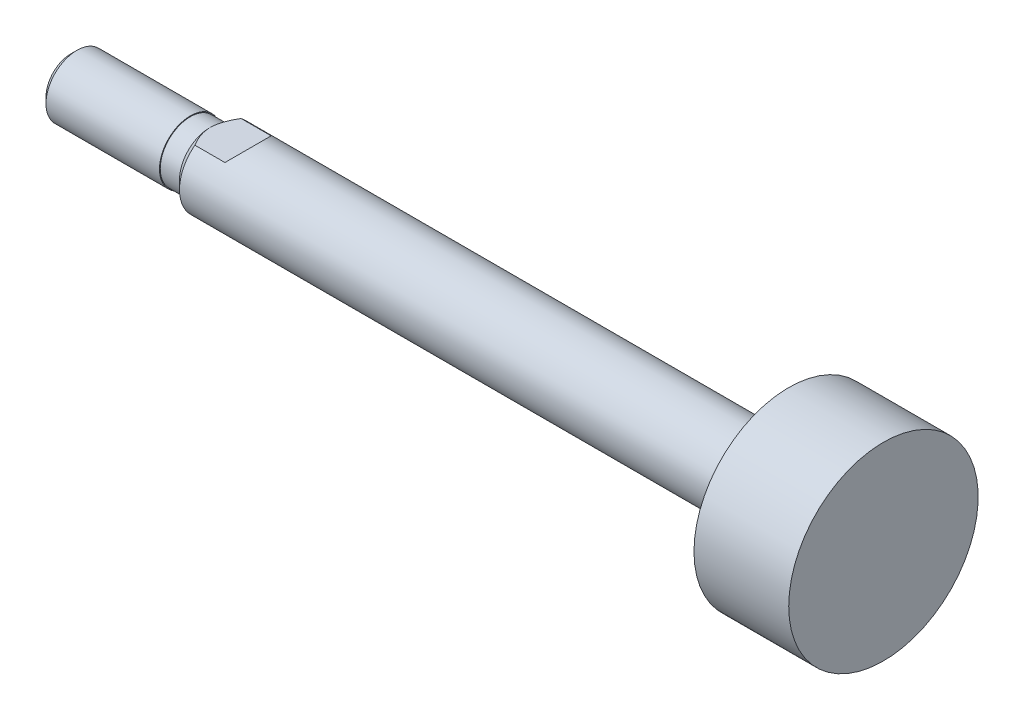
ISO-10303-21;
HEADER;
FILE_DESCRIPTION(('STEP AP214'),'2;1');
FILE_NAME('part.step','',(''),(''),'','','');
FILE_SCHEMA(('AUTOMOTIVE_DESIGN { 1 0 10303 214 1 1 1 1 }'));
ENDSEC;
DATA;
#1=APPLICATION_CONTEXT('core data for automotive mechanical design processes');
#2=APPLICATION_PROTOCOL_DEFINITION('international standard','automotive_design',2000,#1);
#3=PRODUCT_CONTEXT('',#1,'mechanical');
#4=PRODUCT('Part','Part','',(#3));
#5=PRODUCT_RELATED_PRODUCT_CATEGORY('part','',(#4));
#6=PRODUCT_DEFINITION_FORMATION('','',#4);
#7=PRODUCT_DEFINITION_CONTEXT('part definition',#1,'design');
#8=PRODUCT_DEFINITION('design','',#6,#7);
#9=PRODUCT_DEFINITION_SHAPE('','',#8);
#10=(LENGTH_UNIT() NAMED_UNIT(*) SI_UNIT(.MILLI.,.METRE.));
#11=(NAMED_UNIT(*) PLANE_ANGLE_UNIT() SI_UNIT($,.RADIAN.));
#12=(NAMED_UNIT(*) SI_UNIT($,.STERADIAN.) SOLID_ANGLE_UNIT());
#13=UNCERTAINTY_MEASURE_WITH_UNIT(LENGTH_MEASURE(1.E-05),#10,'distance_accuracy_value','');
#14=(GEOMETRIC_REPRESENTATION_CONTEXT(3) GLOBAL_UNCERTAINTY_ASSIGNED_CONTEXT((#13)) GLOBAL_UNIT_ASSIGNED_CONTEXT((#10,
#11,#12)) REPRESENTATION_CONTEXT('',''));
#15=CARTESIAN_POINT('',(0.,0.,0.));
#16=DIRECTION('',(0.,0.,1.));
#17=DIRECTION('',(1.,0.,0.));
#18=AXIS2_PLACEMENT_3D('',#15,#16,#17);
#19=CARTESIAN_POINT('',(-23.,0.,0.));
#20=DIRECTION('',(1.,0.,0.));
#21=DIRECTION('',(0.,0.,-1.));
#22=AXIS2_PLACEMENT_3D('',#19,#20,#21);
#23=PLANE('',#22);
#24=CARTESIAN_POINT('',(-23.,0.,0.));
#25=DIRECTION('',(-1.,0.,0.));
#26=DIRECTION('',(0.,0.,1.));
#27=AXIS2_PLACEMENT_3D('',#24,#25,#26);
#28=CIRCLE('',#27,3.233);
#29=CARTESIAN_POINT('',(-23.,0.,3.233));
#30=VERTEX_POINT('',#29);
#31=EDGE_CURVE('E61',#30,#30,#28,.T.);
#32=ORIENTED_EDGE('',*,*,#31,.T.);
#33=EDGE_LOOP('',(#32));
#34=FACE_BOUND('',#33,.T.);
#35=ADVANCED_FACE('F16',(#34),#23,.F.);
#36=CARTESIAN_POINT('',(-22.233,0.,0.));
#37=DIRECTION('',(1.,0.,0.));
#38=DIRECTION('',(0.,0.,-1.));
#39=AXIS2_PLACEMENT_3D('',#36,#37,#38);
#40=CONICAL_SURFACE('',#39,4.,0.785398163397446);
#41=ORIENTED_EDGE('',*,*,#31,.F.);
#42=EDGE_LOOP('',(#41));
#43=FACE_BOUND('',#42,.T.);
#44=CARTESIAN_POINT('',(-22.233,0.,0.));
#45=DIRECTION('',(-1.,0.,0.));
#46=DIRECTION('',(0.,0.,1.));
#47=AXIS2_PLACEMENT_3D('',#44,#45,#46);
#48=CIRCLE('',#47,4.);
#49=CARTESIAN_POINT('',(-22.233,0.,4.));
#50=VERTEX_POINT('',#49);
#51=EDGE_CURVE('E141',#50,#50,#48,.T.);
#52=ORIENTED_EDGE('',*,*,#51,.T.);
#53=EDGE_LOOP('',(#52));
#54=FACE_BOUND('',#53,.T.);
#55=ADVANCED_FACE('F131',(#43,#54),#40,.T.);
#56=CARTESIAN_POINT('',(82.5,0.,0.));
#57=DIRECTION('',(-1.,0.,0.));
#58=DIRECTION('',(0.,0.,1.));
#59=AXIS2_PLACEMENT_3D('',#56,#57,#58);
#60=CYLINDRICAL_SURFACE('',#59,4.);
#61=ORIENTED_EDGE('',*,*,#51,.F.);
#62=EDGE_LOOP('',(#61));
#63=FACE_BOUND('',#62,.T.);
#64=CARTESIAN_POINT('',(-7.5,0.,0.));
#65=DIRECTION('',(-1.,0.,0.));
#66=DIRECTION('',(0.,0.,1.));
#67=AXIS2_PLACEMENT_3D('',#64,#65,#66);
#68=CIRCLE('',#67,4.);
#69=CARTESIAN_POINT('',(-7.5,0.,4.));
#70=VERTEX_POINT('',#69);
#71=EDGE_CURVE('E144',#70,#70,#68,.T.);
#72=ORIENTED_EDGE('',*,*,#71,.T.);
#73=EDGE_LOOP('',(#72));
#74=FACE_BOUND('',#73,.T.);
#75=ADVANCED_FACE('F137',(#63,#74),#60,.T.);
#76=CARTESIAN_POINT('',(-7.5,4.,0.));
#77=DIRECTION('',(-1.,0.,0.));
#78=DIRECTION('',(0.,0.,1.));
#79=AXIS2_PLACEMENT_3D('',#76,#77,#78);
#80=PLANE('',#79);
#81=ORIENTED_EDGE('',*,*,#71,.F.);
#82=EDGE_LOOP('',(#81));
#83=FACE_BOUND('',#82,.T.);
#84=CARTESIAN_POINT('',(-7.5,0.,0.));
#85=DIRECTION('',(-1.,0.,0.));
#86=DIRECTION('',(0.,0.,1.));
#87=AXIS2_PLACEMENT_3D('',#84,#85,#86);
#88=CIRCLE('',#87,3.9);
#89=CARTESIAN_POINT('',(-7.5,0.,3.9));
#90=VERTEX_POINT('',#89);
#91=EDGE_CURVE('E149',#90,#90,#88,.T.);
#92=ORIENTED_EDGE('',*,*,#91,.T.);
#93=EDGE_LOOP('',(#92));
#94=FACE_BOUND('',#93,.T.);
#95=ADVANCED_FACE('F174',(#83,#94),#80,.F.);
#96=CARTESIAN_POINT('',(82.5,0.,0.));
#97=DIRECTION('',(-1.,0.,0.));
#98=DIRECTION('',(0.,0.,1.));
#99=AXIS2_PLACEMENT_3D('',#96,#97,#98);
#100=CYLINDRICAL_SURFACE('',#99,3.9);
#101=ORIENTED_EDGE('',*,*,#91,.F.);
#102=EDGE_LOOP('',(#101));
#103=FACE_BOUND('',#102,.T.);
#104=CARTESIAN_POINT('',(-5.,0.,0.));
#105=DIRECTION('',(-1.,0.,0.));
#106=DIRECTION('',(0.,0.,1.));
#107=AXIS2_PLACEMENT_3D('',#104,#105,#106);
#108=CIRCLE('',#107,3.9);
#109=CARTESIAN_POINT('',(-5.,0.,3.9));
#110=VERTEX_POINT('',#109);
#111=EDGE_CURVE('E152',#110,#110,#108,.T.);
#112=ORIENTED_EDGE('',*,*,#111,.T.);
#113=EDGE_LOOP('',(#112));
#114=FACE_BOUND('',#113,.T.);
#115=ADVANCED_FACE('F128',(#103,#114),#100,.T.);
#116=CARTESIAN_POINT('',(-3.9,0.,0.));
#117=DIRECTION('',(1.,0.,0.));
#118=DIRECTION('',(0.,0.,-1.));
#119=AXIS2_PLACEMENT_3D('',#116,#117,#118);
#120=CONICAL_SURFACE('',#119,5.,0.785398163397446);
#121=ORIENTED_EDGE('',*,*,#111,.F.);
#122=EDGE_LOOP('',(#121));
#123=FACE_BOUND('',#122,.T.);
#124=CARTESIAN_POINT('',(-3.9,0.,0.));
#125=DIRECTION('',(-1.,0.,0.));
#126=DIRECTION('',(0.,0.,1.));
#127=AXIS2_PLACEMENT_3D('',#124,#125,#126);
#128=CIRCLE('',#127,5.);
#129=CARTESIAN_POINT('',(-3.9,-4.,3.));
#130=VERTEX_POINT('',#129);
#131=CARTESIAN_POINT('',(-3.9,4.,3.));
#132=VERTEX_POINT('',#131);
#133=EDGE_CURVE('E72',#130,#132,#128,.T.);
#134=ORIENTED_EDGE('',*,*,#133,.T.);
#135=CARTESIAN_POINT('',(0.0592148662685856,4.,-8.01670325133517));
#136=CARTESIAN_POINT('',(-0.104734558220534,4.,-7.83345168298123));
#137=CARTESIAN_POINT('',(-0.268089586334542,4.,-7.64966351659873));
#138=CARTESIAN_POINT('',(-0.593295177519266,4.,-7.28073119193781));
#139=CARTESIAN_POINT('',(-0.755145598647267,4.,-7.09558690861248));
#140=CARTESIAN_POINT('',(-1.0776076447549,4.,-6.72298642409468));
#141=CARTESIAN_POINT('',(-1.23821221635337,4.,-6.53552410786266));
#142=CARTESIAN_POINT('',(-1.55707481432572,4.,-6.15862459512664));
#143=CARTESIAN_POINT('',(-1.71533293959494,4.,-5.96918748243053));
#144=CARTESIAN_POINT('',(-2.03813105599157,4.,-5.57660035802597));
#145=CARTESIAN_POINT('',(-2.20249013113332,4.,-5.37330116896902));
#146=CARTESIAN_POINT('',(-2.52679503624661,4.,-4.96321595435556));
#147=CARTESIAN_POINT('',(-2.68674111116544,4.,-4.75643012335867));
#148=CARTESIAN_POINT('',(-3.00041962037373,4.,-4.33867158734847));
#149=CARTESIAN_POINT('',(-3.15416117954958,4.,-4.12770576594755));
#150=CARTESIAN_POINT('',(-3.45331338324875,4.,-3.69997752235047));
#151=CARTESIAN_POINT('',(-3.59872661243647,4.,-3.48321692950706));
#152=CARTESIAN_POINT('',(-3.83936139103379,4.,-3.10248405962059));
#153=CARTESIAN_POINT('',(-3.93742116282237,4.,-2.94031515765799));
#154=CARTESIAN_POINT('',(-4.12514033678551,4.,-2.61105481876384));
#155=CARTESIAN_POINT('',(-4.214796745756,4.,-2.44396165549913));
#156=CARTESIAN_POINT('',(-4.38202517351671,4.,-2.10559748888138));
#157=CARTESIAN_POINT('',(-4.45969673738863,4.,-1.93437628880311));
#158=CARTESIAN_POINT('',(-4.60004030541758,4.,-1.58587891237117));
#159=CARTESIAN_POINT('',(-4.66272371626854,4.,-1.40860745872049));
#160=CARTESIAN_POINT('',(-4.74994261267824,4.,-1.11151605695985));
#161=CARTESIAN_POINT('',(-4.78014609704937,4.,-0.993362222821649));
#162=CARTESIAN_POINT('',(-4.83103250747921,4.,-0.755007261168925));
#163=CARTESIAN_POINT('',(-4.85171703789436,4.,-0.634806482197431));
#164=CARTESIAN_POINT('',(-4.88246398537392,4.,-0.393510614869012));
#165=CARTESIAN_POINT('',(-4.89256745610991,4.,-0.272420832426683));
#166=CARTESIAN_POINT('',(-4.901725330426,4.,-0.0298174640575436));
#167=CARTESIAN_POINT('',(-4.9007798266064,4.,0.0916961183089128));
#168=CARTESIAN_POINT('',(-4.88792304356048,4.,0.33360603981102));
#169=CARTESIAN_POINT('',(-4.87605905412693,4.,0.454004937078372));
#170=CARTESIAN_POINT('',(-4.84208274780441,4.,0.693353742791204));
#171=CARTESIAN_POINT('',(-4.81996803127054,4.,0.812303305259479));
#172=CARTESIAN_POINT('',(-4.76625038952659,4.,1.04947269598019));
#173=CARTESIAN_POINT('',(-4.73453978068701,4.,1.16766782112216));
#174=CARTESIAN_POINT('',(-4.66303307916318,4.,1.40153085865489));
#175=CARTESIAN_POINT('',(-4.62323841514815,4.,1.51719921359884));
#176=CARTESIAN_POINT('',(-4.52401503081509,4.,1.77992372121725));
#177=CARTESIAN_POINT('',(-4.46226527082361,4.,1.92609880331));
#178=CARTESIAN_POINT('',(-4.32977716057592,4.,2.21434798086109));
#179=CARTESIAN_POINT('',(-4.25903403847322,4.,2.35641984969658));
#180=CARTESIAN_POINT('',(-4.11029151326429,4.,2.63733832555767));
#181=CARTESIAN_POINT('',(-4.03226690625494,4.,2.77617148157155));
#182=CARTESIAN_POINT('',(-3.87072949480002,4.,3.05054974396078));
#183=CARTESIAN_POINT('',(-3.78721771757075,4.,3.18609545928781));
#184=CARTESIAN_POINT('',(-3.62008100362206,4.,3.447777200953));
#185=CARTESIAN_POINT('',(-3.53666511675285,4.,3.57404744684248));
#186=CARTESIAN_POINT('',(-3.36665654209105,4.,3.82443880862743));
#187=CARTESIAN_POINT('',(-3.28006360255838,4.,3.94855975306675));
#188=CARTESIAN_POINT('',(-3.1050645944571,4.,4.19387836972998));
#189=CARTESIAN_POINT('',(-3.01668096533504,4.,4.31509210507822));
#190=CARTESIAN_POINT('',(-2.83782414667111,4.,4.55591957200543));
#191=CARTESIAN_POINT('',(-2.74735152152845,4.,4.67553372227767));
#192=CARTESIAN_POINT('',(-2.65603372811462,4.,4.79448796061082));
#193=B_SPLINE_CURVE_WITH_KNOTS('',3,(#135,#136,#137,#138,#139,#140,#141,#142,#143,#144,#145,
#146,#147,#148,#149,#150,#151,#152,#153,#154,#155,#156,#157,#158,#159,#160,#161,#162,#163,#164,
#165,#166,#167,#168,#169,#170,#171,#172,#173,#174,#175,#176,#177,#178,#179,#180,#181,#182,#183,
#184,#185,#186,#187,#188,#189,#190,#191,#192),.UNSPECIFIED.,.F.,.F.,(4,2,2,2,2,2,2,2,2,2,2,2,2,
2,2,2,2,2,2,2,2,2,2,2,2,2,2,2,4),(0.,0.737665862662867,1.47540062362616,2.21594141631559,
2.95645090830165,3.74068924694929,4.52488396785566,5.3078799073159,6.09063151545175,
6.65898208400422,7.22753433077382,7.79107544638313,8.35418630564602,8.71971611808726,
9.08518430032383,9.44922918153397,9.8132710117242,10.1757434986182,10.5383008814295,
10.9050880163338,11.2718103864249,11.7474518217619,12.2233466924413,12.7009546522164,
13.1784734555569,13.6324221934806,14.0864069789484,14.5364269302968,14.9863266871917),.UNSPECIFIED.);
#194=CARTESIAN_POINT('',(-3.9,4.,-3.));
#195=VERTEX_POINT('',#194);
#196=EDGE_CURVE('E82',#132,#195,#193,.F.);
#197=ORIENTED_EDGE('',*,*,#196,.T.);
#198=CARTESIAN_POINT('',(-3.9,-4.,-3.));
#199=VERTEX_POINT('',#198);
#200=EDGE_CURVE('E155',#195,#199,#128,.T.);
#201=ORIENTED_EDGE('',*,*,#200,.T.);
#202=CARTESIAN_POINT('',(0.0592148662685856,-4.,-8.01670325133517));
#203=CARTESIAN_POINT('',(-0.104734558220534,-4.,-7.83345168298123));
#204=CARTESIAN_POINT('',(-0.268089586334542,-4.,-7.64966351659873));
#205=CARTESIAN_POINT('',(-0.593295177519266,-4.,-7.28073119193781));
#206=CARTESIAN_POINT('',(-0.755145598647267,-4.,-7.09558690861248));
#207=CARTESIAN_POINT('',(-1.0776076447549,-4.,-6.72298642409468));
#208=CARTESIAN_POINT('',(-1.23821221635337,-4.,-6.53552410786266));
#209=CARTESIAN_POINT('',(-1.55707481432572,-4.,-6.15862459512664));
#210=CARTESIAN_POINT('',(-1.71533293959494,-4.,-5.96918748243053));
#211=CARTESIAN_POINT('',(-2.03813105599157,-4.,-5.57660035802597));
#212=CARTESIAN_POINT('',(-2.20249013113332,-4.,-5.37330116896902));
#213=CARTESIAN_POINT('',(-2.52679503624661,-4.,-4.96321595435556));
#214=CARTESIAN_POINT('',(-2.68674111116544,-4.,-4.75643012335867));
#215=CARTESIAN_POINT('',(-3.00041962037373,-4.,-4.33867158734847));
#216=CARTESIAN_POINT('',(-3.15416117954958,-4.,-4.12770576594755));
#217=CARTESIAN_POINT('',(-3.45331338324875,-4.,-3.69997752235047));
#218=CARTESIAN_POINT('',(-3.59872661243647,-4.,-3.48321692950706));
#219=CARTESIAN_POINT('',(-3.83936139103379,-4.,-3.10248405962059));
#220=CARTESIAN_POINT('',(-3.93742116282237,-4.,-2.94031515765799));
#221=CARTESIAN_POINT('',(-4.12514033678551,-4.,-2.61105481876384));
#222=CARTESIAN_POINT('',(-4.214796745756,-4.,-2.44396165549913));
#223=CARTESIAN_POINT('',(-4.38202517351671,-4.,-2.10559748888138));
#224=CARTESIAN_POINT('',(-4.45969673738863,-4.,-1.93437628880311));
#225=CARTESIAN_POINT('',(-4.60004030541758,-4.,-1.58587891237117));
#226=CARTESIAN_POINT('',(-4.66272371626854,-4.,-1.40860745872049));
#227=CARTESIAN_POINT('',(-4.74994261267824,-4.,-1.11151605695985));
#228=CARTESIAN_POINT('',(-4.78014609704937,-4.,-0.993362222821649));
#229=CARTESIAN_POINT('',(-4.83103250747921,-4.,-0.755007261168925));
#230=CARTESIAN_POINT('',(-4.85171703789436,-4.,-0.634806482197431));
#231=CARTESIAN_POINT('',(-4.88246398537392,-4.,-0.393510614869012));
#232=CARTESIAN_POINT('',(-4.89256745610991,-4.,-0.272420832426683));
#233=CARTESIAN_POINT('',(-4.901725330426,-4.,-0.0298174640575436));
#234=CARTESIAN_POINT('',(-4.9007798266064,-4.,0.0916961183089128));
#235=CARTESIAN_POINT('',(-4.88792304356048,-4.,0.33360603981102));
#236=CARTESIAN_POINT('',(-4.87605905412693,-4.,0.454004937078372));
#237=CARTESIAN_POINT('',(-4.84208274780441,-4.,0.693353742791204));
#238=CARTESIAN_POINT('',(-4.81996803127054,-4.,0.812303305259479));
#239=CARTESIAN_POINT('',(-4.76625038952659,-4.,1.04947269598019));
#240=CARTESIAN_POINT('',(-4.73453978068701,-4.,1.16766782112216));
#241=CARTESIAN_POINT('',(-4.66303307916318,-4.,1.40153085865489));
#242=CARTESIAN_POINT('',(-4.62323841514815,-4.,1.51719921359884));
#243=CARTESIAN_POINT('',(-4.52401503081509,-4.,1.77992372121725));
#244=CARTESIAN_POINT('',(-4.46226527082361,-4.,1.92609880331));
#245=CARTESIAN_POINT('',(-4.32977716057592,-4.,2.21434798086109));
#246=CARTESIAN_POINT('',(-4.25903403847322,-4.,2.35641984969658));
#247=CARTESIAN_POINT('',(-4.11029151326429,-4.,2.63733832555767));
#248=CARTESIAN_POINT('',(-4.03226690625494,-4.,2.77617148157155));
#249=CARTESIAN_POINT('',(-3.87072949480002,-4.,3.05054974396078));
#250=CARTESIAN_POINT('',(-3.78721771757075,-4.,3.18609545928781));
#251=CARTESIAN_POINT('',(-3.62008100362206,-4.,3.447777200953));
#252=CARTESIAN_POINT('',(-3.53666511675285,-4.,3.57404744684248));
#253=CARTESIAN_POINT('',(-3.36665654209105,-4.,3.82443880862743));
#254=CARTESIAN_POINT('',(-3.28006360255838,-4.,3.94855975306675));
#255=CARTESIAN_POINT('',(-3.1050645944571,-4.,4.19387836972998));
#256=CARTESIAN_POINT('',(-3.01668096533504,-4.,4.31509210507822));
#257=CARTESIAN_POINT('',(-2.83782414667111,-4.,4.55591957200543));
#258=CARTESIAN_POINT('',(-2.74735152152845,-4.,4.67553372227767));
#259=CARTESIAN_POINT('',(-2.65603372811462,-4.,4.79448796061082));
#260=B_SPLINE_CURVE_WITH_KNOTS('',3,(#202,#203,#204,#205,#206,#207,#208,#209,#210,#211,#212,
#213,#214,#215,#216,#217,#218,#219,#220,#221,#222,#223,#224,#225,#226,#227,#228,#229,#230,#231,
#232,#233,#234,#235,#236,#237,#238,#239,#240,#241,#242,#243,#244,#245,#246,#247,#248,#249,#250,
#251,#252,#253,#254,#255,#256,#257,#258,#259),.UNSPECIFIED.,.F.,.F.,(4,2,2,2,2,2,2,2,2,2,2,2,2,
2,2,2,2,2,2,2,2,2,2,2,2,2,2,2,4),(0.,0.737665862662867,1.47540062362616,2.21594141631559,
2.95645090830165,3.74068924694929,4.52488396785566,5.3078799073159,6.09063151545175,
6.65898208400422,7.22753433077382,7.79107544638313,8.35418630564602,8.71971611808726,
9.08518430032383,9.44922918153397,9.8132710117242,10.1757434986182,10.5383008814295,
10.9050880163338,11.2718103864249,11.7474518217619,12.2233466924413,12.7009546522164,
13.1784734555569,13.6324221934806,14.0864069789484,14.5364269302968,14.9863266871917),.UNSPECIFIED.);
#261=EDGE_CURVE('E84',#199,#130,#260,.T.);
#262=ORIENTED_EDGE('',*,*,#261,.T.);
#263=EDGE_LOOP('',(#134,#197,#201,#262));
#264=FACE_BOUND('',#263,.T.);
#265=ADVANCED_FACE('F100',(#123,#264),#120,.T.);
#266=CARTESIAN_POINT('',(82.5,0.,0.));
#267=DIRECTION('',(-1.,0.,0.));
#268=DIRECTION('',(0.,0.,1.));
#269=AXIS2_PLACEMENT_3D('',#266,#267,#268);
#270=CYLINDRICAL_SURFACE('',#269,5.);
#271=CARTESIAN_POINT('',(-4.,0.,0.));
#272=DIRECTION('',(0.707106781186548,-0.707106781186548,0.));
#273=DIRECTION('',(-0.707106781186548,-0.707106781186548,0.));
#274=AXIS2_PLACEMENT_3D('',#271,#272,#273);
#275=ELLIPSE('',#274,7.07106781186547,5.);
#276=CARTESIAN_POINT('',(0.,4.,-3.));
#277=VERTEX_POINT('',#276);
#278=CARTESIAN_POINT('',(0.,4.,3.));
#279=VERTEX_POINT('',#278);
#280=EDGE_CURVE('E23',#277,#279,#275,.T.);
#281=ORIENTED_EDGE('',*,*,#280,.T.);
#282=DIRECTION('',(-1.,0.,0.));
#283=VECTOR('',#282,1.);
#284=CARTESIAN_POINT('',(82.5,4.,3.));
#285=LINE('',#284,#283);
#286=EDGE_CURVE('E11',#279,#132,#285,.T.);
#287=ORIENTED_EDGE('',*,*,#286,.T.);
#288=ORIENTED_EDGE('',*,*,#133,.F.);
#289=DIRECTION('',(-1.,0.,0.));
#290=VECTOR('',#289,1.);
#291=CARTESIAN_POINT('',(82.5,-4.,3.));
#292=LINE('',#291,#290);
#293=CARTESIAN_POINT('',(0.,-4.,3.));
#294=VERTEX_POINT('',#293);
#295=EDGE_CURVE('E65',#130,#294,#292,.F.);
#296=ORIENTED_EDGE('',*,*,#295,.T.);
#297=CARTESIAN_POINT('',(-4.,0.,0.));
#298=DIRECTION('',(0.707106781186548,0.707106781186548,0.));
#299=DIRECTION('',(-0.707106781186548,0.707106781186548,0.));
#300=AXIS2_PLACEMENT_3D('',#297,#298,#299);
#301=ELLIPSE('',#300,7.07106781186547,5.);
#302=CARTESIAN_POINT('',(0.,-4.,-3.));
#303=VERTEX_POINT('',#302);
#304=EDGE_CURVE('E55',#294,#303,#301,.T.);
#305=ORIENTED_EDGE('',*,*,#304,.T.);
#306=DIRECTION('',(-1.,0.,0.));
#307=VECTOR('',#306,1.);
#308=CARTESIAN_POINT('',(82.5,-4.,-3.));
#309=LINE('',#308,#307);
#310=EDGE_CURVE('E60',#303,#199,#309,.T.);
#311=ORIENTED_EDGE('',*,*,#310,.T.);
#312=ORIENTED_EDGE('',*,*,#200,.F.);
#313=DIRECTION('',(-1.,0.,0.));
#314=VECTOR('',#313,1.);
#315=CARTESIAN_POINT('',(82.5,4.,-3.));
#316=LINE('',#315,#314);
#317=EDGE_CURVE('E73',#195,#277,#316,.F.);
#318=ORIENTED_EDGE('',*,*,#317,.T.);
#319=EDGE_LOOP('',(#281,#287,#288,#296,#305,#311,#312,#318));
#320=FACE_BOUND('',#319,.T.);
#321=CARTESIAN_POINT('',(70.2,0.,0.));
#322=DIRECTION('',(-1.,0.,0.));
#323=DIRECTION('',(0.,0.,1.));
#324=AXIS2_PLACEMENT_3D('',#321,#322,#323);
#325=CIRCLE('',#324,5.);
#326=CARTESIAN_POINT('',(70.2,0.,5.));
#327=VERTEX_POINT('',#326);
#328=EDGE_CURVE('E157',#327,#327,#325,.T.);
#329=ORIENTED_EDGE('',*,*,#328,.T.);
#330=EDGE_LOOP('',(#329));
#331=FACE_BOUND('',#330,.T.);
#332=ADVANCED_FACE('F69',(#320,#331),#270,.T.);
#333=CARTESIAN_POINT('',(70.2,5.,0.));
#334=DIRECTION('',(1.,0.,0.));
#335=DIRECTION('',(0.,0.,-1.));
#336=AXIS2_PLACEMENT_3D('',#333,#334,#335);
#337=PLANE('',#336);
#338=ORIENTED_EDGE('',*,*,#328,.F.);
#339=EDGE_LOOP('',(#338));
#340=FACE_BOUND('',#339,.T.);
#341=CARTESIAN_POINT('',(70.2,0.,0.));
#342=DIRECTION('',(-1.,0.,0.));
#343=DIRECTION('',(0.,0.,1.));
#344=AXIS2_PLACEMENT_3D('',#341,#342,#343);
#345=CIRCLE('',#344,12.3);
#346=CARTESIAN_POINT('',(70.2,0.,12.3));
#347=VERTEX_POINT('',#346);
#348=EDGE_CURVE('E160',#347,#347,#345,.T.);
#349=ORIENTED_EDGE('',*,*,#348,.T.);
#350=EDGE_LOOP('',(#349));
#351=FACE_BOUND('',#350,.T.);
#352=ADVANCED_FACE('F118',(#340,#351),#337,.F.);
#353=CARTESIAN_POINT('',(82.5,0.,0.));
#354=DIRECTION('',(-1.,0.,0.));
#355=DIRECTION('',(0.,0.,1.));
#356=AXIS2_PLACEMENT_3D('',#353,#354,#355);
#357=CYLINDRICAL_SURFACE('',#356,12.3);
#358=ORIENTED_EDGE('',*,*,#348,.F.);
#359=EDGE_LOOP('',(#358));
#360=FACE_BOUND('',#359,.T.);
#361=CARTESIAN_POINT('',(82.5,0.,0.));
#362=DIRECTION('',(-1.,0.,0.));
#363=DIRECTION('',(0.,0.,1.));
#364=AXIS2_PLACEMENT_3D('',#361,#362,#363);
#365=CIRCLE('',#364,12.3);
#366=CARTESIAN_POINT('',(82.5,0.,12.3));
#367=VERTEX_POINT('',#366);
#368=EDGE_CURVE('E162',#367,#367,#365,.T.);
#369=ORIENTED_EDGE('',*,*,#368,.T.);
#370=EDGE_LOOP('',(#369));
#371=FACE_BOUND('',#370,.T.);
#372=ADVANCED_FACE('F114',(#360,#371),#357,.T.);
#373=CARTESIAN_POINT('',(82.5,12.3,0.));
#374=DIRECTION('',(-1.,0.,0.));
#375=DIRECTION('',(0.,0.,1.));
#376=AXIS2_PLACEMENT_3D('',#373,#374,#375);
#377=PLANE('',#376);
#378=ORIENTED_EDGE('',*,*,#368,.F.);
#379=EDGE_LOOP('',(#378));
#380=FACE_BOUND('',#379,.T.);
#381=ADVANCED_FACE('F111',(#380),#377,.F.);
#382=CARTESIAN_POINT('',(1.,-5.,-10.));
#383=DIRECTION('',(0.707106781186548,0.707106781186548,0.));
#384=DIRECTION('',(-0.707106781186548,0.707106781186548,0.));
#385=AXIS2_PLACEMENT_3D('',#382,#383,#384);
#386=PLANE('',#385);
#387=DIRECTION('',(0.,0.,1.));
#388=VECTOR('',#387,1.);
#389=CARTESIAN_POINT('',(0.,-4.,-10.));
#390=LINE('',#389,#388);
#391=EDGE_CURVE('E37',#303,#294,#390,.T.);
#392=ORIENTED_EDGE('',*,*,#391,.F.);
#393=ORIENTED_EDGE('',*,*,#304,.F.);
#394=EDGE_LOOP('',(#392,#393));
#395=FACE_BOUND('',#394,.T.);
#396=ADVANCED_FACE('F56',(#395),#386,.F.);
#397=CARTESIAN_POINT('',(0.,-4.,-10.));
#398=DIRECTION('',(0.,1.,0.));
#399=DIRECTION('',(0.,0.,1.));
#400=AXIS2_PLACEMENT_3D('',#397,#398,#399);
#401=PLANE('',#400);
#402=ORIENTED_EDGE('',*,*,#391,.T.);
#403=ORIENTED_EDGE('',*,*,#295,.F.);
#404=ORIENTED_EDGE('',*,*,#261,.F.);
#405=ORIENTED_EDGE('',*,*,#310,.F.);
#406=EDGE_LOOP('',(#402,#403,#404,#405));
#407=FACE_BOUND('',#406,.T.);
#408=ADVANCED_FACE('F64',(#407),#401,.F.);
#409=CARTESIAN_POINT('',(0.,4.,-10.));
#410=DIRECTION('',(0.707106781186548,-0.707106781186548,0.));
#411=DIRECTION('',(0.707106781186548,0.707106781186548,0.));
#412=AXIS2_PLACEMENT_3D('',#409,#410,#411);
#413=PLANE('',#412);
#414=DIRECTION('',(0.,0.,1.));
#415=VECTOR('',#414,1.);
#416=CARTESIAN_POINT('',(0.,4.,-10.));
#417=LINE('',#416,#415);
#418=EDGE_CURVE('E30',#277,#279,#417,.T.);
#419=ORIENTED_EDGE('',*,*,#418,.T.);
#420=ORIENTED_EDGE('',*,*,#280,.F.);
#421=EDGE_LOOP('',(#419,#420));
#422=FACE_BOUND('',#421,.T.);
#423=ADVANCED_FACE('F83',(#422),#413,.F.);
#424=CARTESIAN_POINT('',(-27.,4.,-10.));
#425=DIRECTION('',(0.,-1.,0.));
#426=DIRECTION('',(0.,0.,-1.));
#427=AXIS2_PLACEMENT_3D('',#424,#425,#426);
#428=PLANE('',#427);
#429=ORIENTED_EDGE('',*,*,#418,.F.);
#430=ORIENTED_EDGE('',*,*,#317,.F.);
#431=ORIENTED_EDGE('',*,*,#196,.F.);
#432=ORIENTED_EDGE('',*,*,#286,.F.);
#433=EDGE_LOOP('',(#429,#430,#431,#432));
#434=FACE_BOUND('',#433,.T.);
#435=ADVANCED_FACE('F80',(#434),#428,.F.);
#436=CLOSED_SHELL('',(#35,#55,#75,#95,#115,#265,#332,#352,#372,#381,#396,#408,#423,#435));
#437=MANIFOLD_SOLID_BREP('B1',#436);
#438=ADVANCED_BREP_SHAPE_REPRESENTATION('',(#18,#437),#14);
#439=SHAPE_DEFINITION_REPRESENTATION(#9,#438);
ENDSEC;
END-ISO-10303-21;
